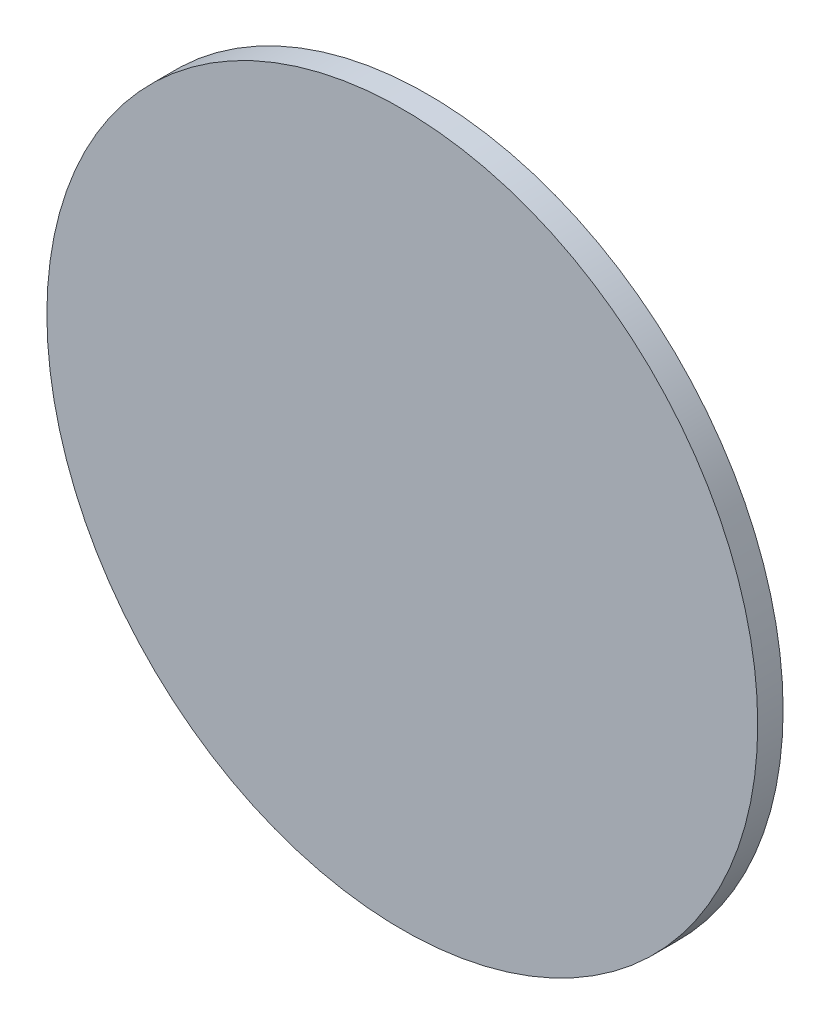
ISO-10303-21;
HEADER;
FILE_DESCRIPTION(('STEP AP214'),'2;1');
FILE_NAME('part.step','',(''),(''),'','','');
FILE_SCHEMA(('AUTOMOTIVE_DESIGN { 1 0 10303 214 1 1 1 1 }'));
ENDSEC;
DATA;
#1=APPLICATION_CONTEXT('core data for automotive mechanical design processes');
#2=APPLICATION_PROTOCOL_DEFINITION('international standard','automotive_design',2000,#1);
#3=PRODUCT_CONTEXT('',#1,'mechanical');
#4=PRODUCT('Part','Part','',(#3));
#5=PRODUCT_RELATED_PRODUCT_CATEGORY('part','',(#4));
#6=PRODUCT_DEFINITION_FORMATION('','',#4);
#7=PRODUCT_DEFINITION_CONTEXT('part definition',#1,'design');
#8=PRODUCT_DEFINITION('design','',#6,#7);
#9=PRODUCT_DEFINITION_SHAPE('','',#8);
#10=(LENGTH_UNIT() NAMED_UNIT(*) SI_UNIT(.MILLI.,.METRE.));
#11=(NAMED_UNIT(*) PLANE_ANGLE_UNIT() SI_UNIT($,.RADIAN.));
#12=(NAMED_UNIT(*) SI_UNIT($,.STERADIAN.) SOLID_ANGLE_UNIT());
#13=UNCERTAINTY_MEASURE_WITH_UNIT(LENGTH_MEASURE(1.E-05),#10,'distance_accuracy_value','');
#14=(GEOMETRIC_REPRESENTATION_CONTEXT(3) GLOBAL_UNCERTAINTY_ASSIGNED_CONTEXT((#13)) GLOBAL_UNIT_ASSIGNED_CONTEXT((#10,
#11,#12)) REPRESENTATION_CONTEXT('',''));
#15=CARTESIAN_POINT('',(0.,0.,0.));
#16=DIRECTION('',(0.,0.,1.));
#17=DIRECTION('',(1.,0.,0.));
#18=AXIS2_PLACEMENT_3D('',#15,#16,#17);
#19=CARTESIAN_POINT('',(0.,0.,1.));
#20=DIRECTION('',(0.,0.,-1.));
#21=DIRECTION('',(-1.,0.,0.));
#22=AXIS2_PLACEMENT_3D('',#19,#20,#21);
#23=CYLINDRICAL_SURFACE('',#22,14.);
#24=CARTESIAN_POINT('',(0.,0.,1.));
#25=DIRECTION('',(0.,0.,1.));
#26=DIRECTION('',(1.,0.,0.));
#27=AXIS2_PLACEMENT_3D('',#24,#25,#26);
#28=CIRCLE('',#27,14.);
#29=CARTESIAN_POINT('',(14.,0.,1.));
#30=VERTEX_POINT('',#29);
#31=EDGE_CURVE('E10',#30,#30,#28,.T.);
#32=ORIENTED_EDGE('',*,*,#31,.F.);
#33=EDGE_LOOP('',(#32));
#34=FACE_BOUND('',#33,.T.);
#35=CARTESIAN_POINT('',(0.,0.,0.));
#36=DIRECTION('',(0.,0.,1.));
#37=DIRECTION('',(1.,0.,0.));
#38=AXIS2_PLACEMENT_3D('',#35,#36,#37);
#39=CIRCLE('',#38,14.);
#40=CARTESIAN_POINT('',(14.,0.,0.));
#41=VERTEX_POINT('',#40);
#42=EDGE_CURVE('E40',#41,#41,#39,.T.);
#43=ORIENTED_EDGE('',*,*,#42,.T.);
#44=EDGE_LOOP('',(#43));
#45=FACE_BOUND('',#44,.T.);
#46=ADVANCED_FACE('F37',(#34,#45),#23,.T.);
#47=CARTESIAN_POINT('',(0.,0.,1.));
#48=DIRECTION('',(0.,0.,1.));
#49=DIRECTION('',(1.,0.,0.));
#50=AXIS2_PLACEMENT_3D('',#47,#48,#49);
#51=PLANE('',#50);
#52=ORIENTED_EDGE('',*,*,#31,.T.);
#53=EDGE_LOOP('',(#52));
#54=FACE_BOUND('',#53,.T.);
#55=ADVANCED_FACE('F52',(#54),#51,.T.);
#56=CARTESIAN_POINT('',(0.,0.,0.));
#57=DIRECTION('',(0.,0.,1.));
#58=DIRECTION('',(1.,0.,0.));
#59=AXIS2_PLACEMENT_3D('',#56,#57,#58);
#60=PLANE('',#59);
#61=ORIENTED_EDGE('',*,*,#42,.F.);
#62=EDGE_LOOP('',(#61));
#63=FACE_BOUND('',#62,.T.);
#64=ADVANCED_FACE('F50',(#63),#60,.F.);
#65=CLOSED_SHELL('',(#46,#55,#64));
#66=MANIFOLD_SOLID_BREP('B2',#65);
#67=ADVANCED_BREP_SHAPE_REPRESENTATION('',(#18,#66),#14);
#68=SHAPE_DEFINITION_REPRESENTATION(#9,#67);
ENDSEC;
END-ISO-10303-21;
